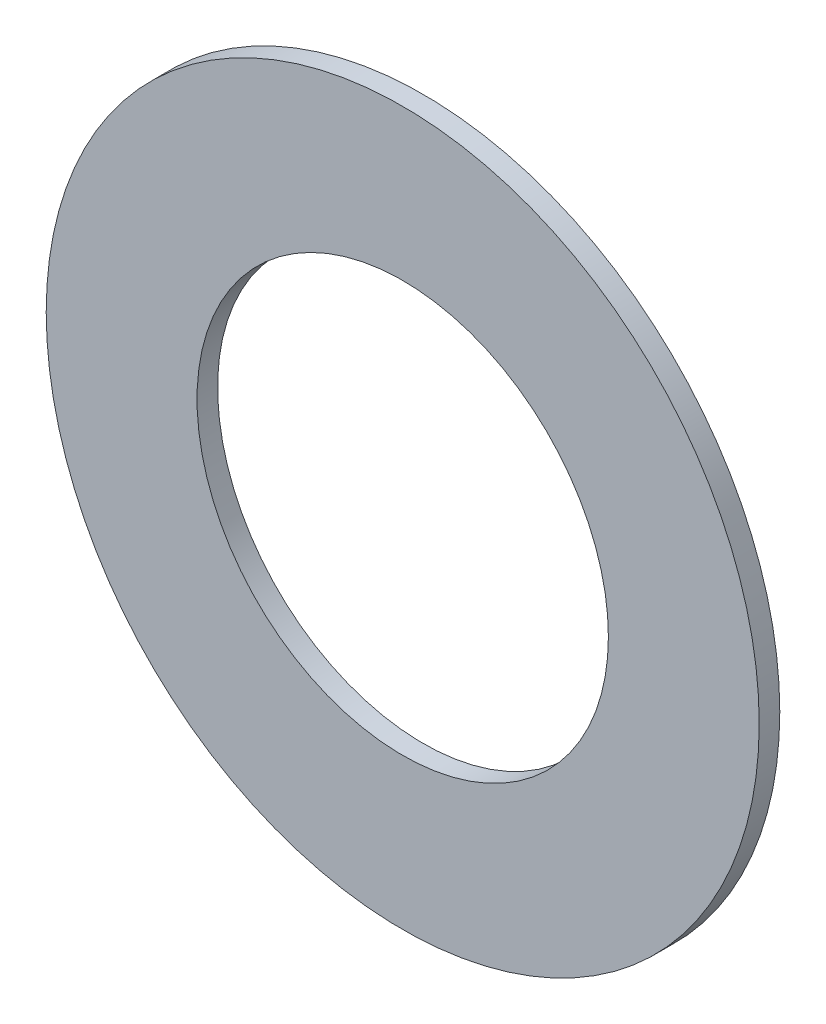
from build123d import *

# Parameters (mm, degrees)
SKETCH_1_R          = 26
EXTRUDE_1_DEPTH     = 1.5
SKETCH_2_R          = 15
CUT_EXTRUDE_1_DEPTH = 10


with BuildPart() as part:
    # Sketch 1 → Extrude 1 (new body)
    with BuildSketch(Plane.XY):
        Circle(SKETCH_1_R)
    extrude(amount=EXTRUDE_1_DEPTH)

    # Sketch 2 → Cut-Extrude 1 (cut)
    with BuildSketch(Plane.XY.offset(1.5)):
        Circle(SKETCH_2_R)
    extrude(amount=-CUT_EXTRUDE_1_DEPTH, mode=Mode.SUBTRACT)


solid = part.part
